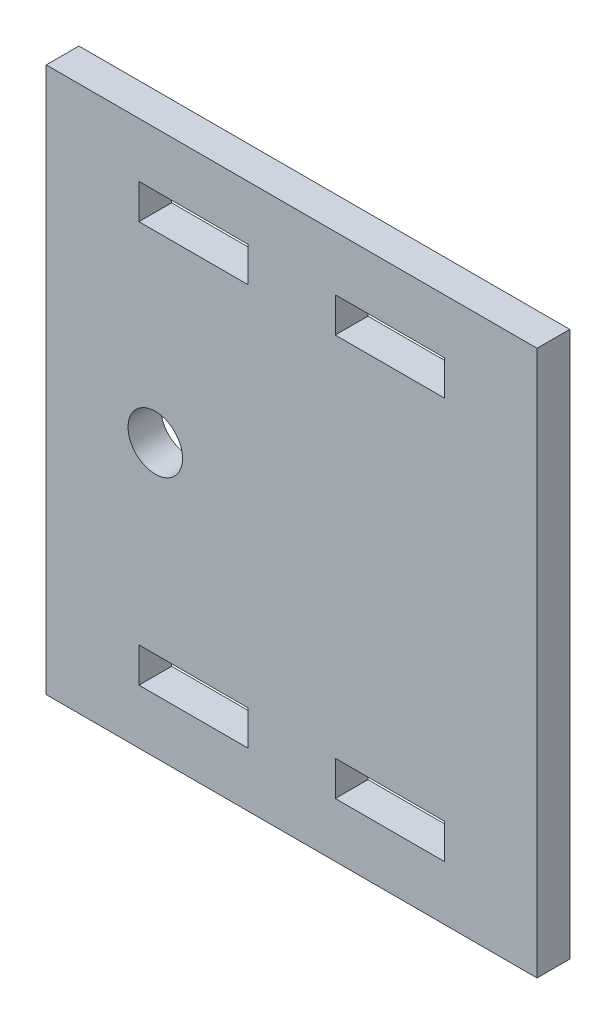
from build123d import *

# Parameters (mm, degrees)
ESQUISSE1_W        = 45
ESQUISSE1_H        = 50
ESQUISSE1_R        = 2.5
ESQUISSE1_W_2      = 10
ESQUISSE1_H_2      = 3.2
BOSS_EXTRU_1_DEPTH = 3


with BuildPart() as part:
    # Esquisse1 → Boss.-Extru.1 (new body)
    with BuildSketch(Plane.XY):
        with Locations((12.5, 0)):
            Rectangle(ESQUISSE1_W, ESQUISSE1_H)
        Circle(ESQUISSE1_R, mode=Mode.SUBTRACT)
        with Locations((3.5, 18.4)):
            Rectangle(ESQUISSE1_W_2, ESQUISSE1_H_2, mode=Mode.SUBTRACT)
        with Locations((21.5, 18.4)):
            Rectangle(ESQUISSE1_W_2, ESQUISSE1_H_2, mode=Mode.SUBTRACT)
        with Locations((21.5, -18.4)):
            Rectangle(ESQUISSE1_W_2, ESQUISSE1_H_2, mode=Mode.SUBTRACT)
        with Locations((3.5, -18.4)):
            Rectangle(ESQUISSE1_W_2, ESQUISSE1_H_2, mode=Mode.SUBTRACT)
    extrude(amount=BOSS_EXTRU_1_DEPTH)


solid = part.part
